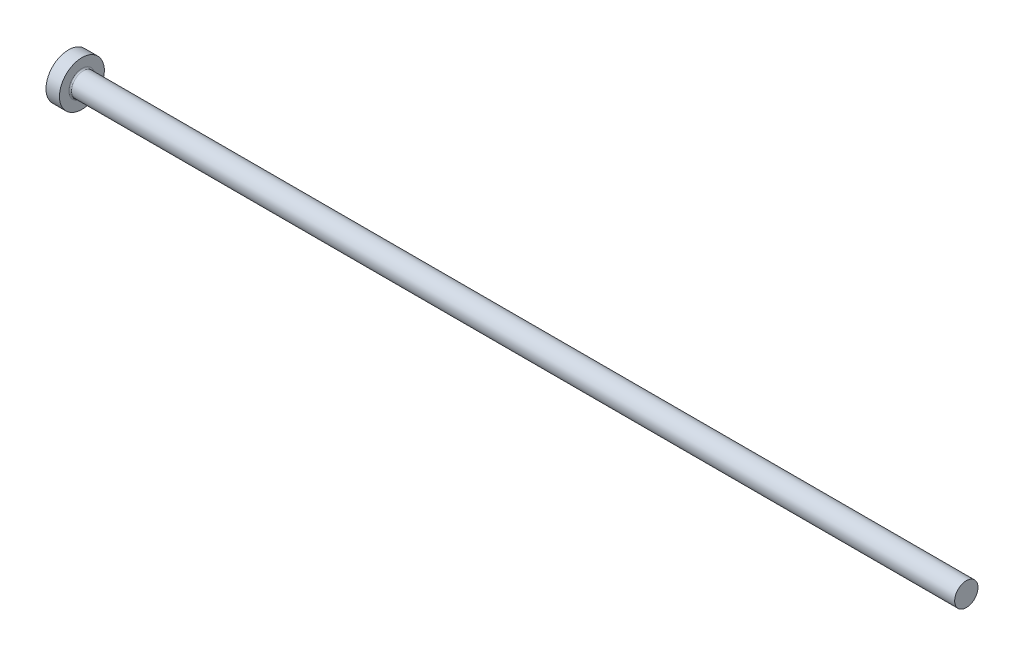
ISO-10303-21;
HEADER;
FILE_DESCRIPTION(('STEP AP214'),'2;1');
FILE_NAME('part.step','',(''),(''),'','','');
FILE_SCHEMA(('AUTOMOTIVE_DESIGN { 1 0 10303 214 1 1 1 1 }'));
ENDSEC;
DATA;
#1=APPLICATION_CONTEXT('core data for automotive mechanical design processes');
#2=APPLICATION_PROTOCOL_DEFINITION('international standard','automotive_design',2000,#1);
#3=PRODUCT_CONTEXT('',#1,'mechanical');
#4=PRODUCT('Part','Part','',(#3));
#5=PRODUCT_RELATED_PRODUCT_CATEGORY('part','',(#4));
#6=PRODUCT_DEFINITION_FORMATION('','',#4);
#7=PRODUCT_DEFINITION_CONTEXT('part definition',#1,'design');
#8=PRODUCT_DEFINITION('design','',#6,#7);
#9=PRODUCT_DEFINITION_SHAPE('','',#8);
#10=(LENGTH_UNIT() NAMED_UNIT(*) SI_UNIT(.MILLI.,.METRE.));
#11=(NAMED_UNIT(*) PLANE_ANGLE_UNIT() SI_UNIT($,.RADIAN.));
#12=(NAMED_UNIT(*) SI_UNIT($,.STERADIAN.) SOLID_ANGLE_UNIT());
#13=UNCERTAINTY_MEASURE_WITH_UNIT(LENGTH_MEASURE(1.E-05),#10,'distance_accuracy_value','');
#14=(GEOMETRIC_REPRESENTATION_CONTEXT(3) GLOBAL_UNCERTAINTY_ASSIGNED_CONTEXT((#13)) GLOBAL_UNIT_ASSIGNED_CONTEXT((#10,
#11,#12)) REPRESENTATION_CONTEXT('',''));
#15=CARTESIAN_POINT('',(0.,0.,0.));
#16=DIRECTION('',(0.,0.,1.));
#17=DIRECTION('',(1.,0.,0.));
#18=AXIS2_PLACEMENT_3D('',#15,#16,#17);
#19=CARTESIAN_POINT('',(0.,0.,0.));
#20=DIRECTION('',(-1.,0.,0.));
#21=DIRECTION('',(0.,-1.,0.));
#22=AXIS2_PLACEMENT_3D('',#19,#20,#21);
#23=PLANE('',#22);
#24=CARTESIAN_POINT('',(0.,0.,0.));
#25=DIRECTION('',(1.,0.,0.));
#26=DIRECTION('',(0.,1.,0.));
#27=AXIS2_PLACEMENT_3D('',#24,#25,#26);
#28=CIRCLE('',#27,5.);
#29=CARTESIAN_POINT('',(0.,5.,0.));
#30=VERTEX_POINT('',#29);
#31=EDGE_CURVE('E25',#30,#30,#28,.T.);
#32=ORIENTED_EDGE('',*,*,#31,.F.);
#33=EDGE_LOOP('',(#32));
#34=FACE_BOUND('',#33,.T.);
#35=ADVANCED_FACE('F14',(#34),#23,.T.);
#36=CARTESIAN_POINT('',(200.,0.,0.));
#37=DIRECTION('',(1.,0.,0.));
#38=DIRECTION('',(0.,1.,0.));
#39=AXIS2_PLACEMENT_3D('',#36,#37,#38);
#40=CYLINDRICAL_SURFACE('',#39,5.);
#41=ORIENTED_EDGE('',*,*,#31,.T.);
#42=EDGE_LOOP('',(#41));
#43=FACE_BOUND('',#42,.T.);
#44=CARTESIAN_POINT('',(3.,0.,0.));
#45=DIRECTION('',(1.,0.,0.));
#46=DIRECTION('',(0.,1.,0.));
#47=AXIS2_PLACEMENT_3D('',#44,#45,#46);
#48=CIRCLE('',#47,5.);
#49=CARTESIAN_POINT('',(3.,5.,0.));
#50=VERTEX_POINT('',#49);
#51=EDGE_CURVE('E29',#50,#50,#48,.T.);
#52=ORIENTED_EDGE('',*,*,#51,.F.);
#53=EDGE_LOOP('',(#52));
#54=FACE_BOUND('',#53,.T.);
#55=ADVANCED_FACE('F51',(#43,#54),#40,.T.);
#56=CARTESIAN_POINT('',(3.,5.,0.));
#57=DIRECTION('',(1.,0.,0.));
#58=DIRECTION('',(0.,1.,0.));
#59=AXIS2_PLACEMENT_3D('',#56,#57,#58);
#60=PLANE('',#59);
#61=CARTESIAN_POINT('',(3.,0.,0.));
#62=DIRECTION('',(1.,0.,0.));
#63=DIRECTION('',(0.,1.,0.));
#64=AXIS2_PLACEMENT_3D('',#61,#62,#63);
#65=CIRCLE('',#64,2.89999999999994);
#66=CARTESIAN_POINT('',(3.,2.89999999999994,0.));
#67=VERTEX_POINT('',#66);
#68=EDGE_CURVE('E9',#67,#67,#65,.F.);
#69=ORIENTED_EDGE('',*,*,#68,.T.);
#70=EDGE_LOOP('',(#69));
#71=FACE_BOUND('',#70,.T.);
#72=ORIENTED_EDGE('',*,*,#51,.T.);
#73=EDGE_LOOP('',(#72));
#74=FACE_BOUND('',#73,.T.);
#75=ADVANCED_FACE('F42',(#71,#74),#60,.T.);
#76=CARTESIAN_POINT('',(200.,0.,0.));
#77=DIRECTION('',(1.,0.,0.));
#78=DIRECTION('',(0.,1.,0.));
#79=AXIS2_PLACEMENT_3D('',#76,#77,#78);
#80=CYLINDRICAL_SURFACE('',#79,2.59999999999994);
#81=CARTESIAN_POINT('',(3.3,0.,0.));
#82=DIRECTION('',(1.,0.,0.));
#83=DIRECTION('',(0.,1.,0.));
#84=AXIS2_PLACEMENT_3D('',#81,#82,#83);
#85=CIRCLE('',#84,2.59999999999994);
#86=CARTESIAN_POINT('',(3.3,2.59999999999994,0.));
#87=VERTEX_POINT('',#86);
#88=EDGE_CURVE('E21',#87,#87,#85,.T.);
#89=ORIENTED_EDGE('',*,*,#88,.T.);
#90=EDGE_LOOP('',(#89));
#91=FACE_BOUND('',#90,.T.);
#92=CARTESIAN_POINT('',(200.,0.,0.));
#93=DIRECTION('',(1.,0.,0.));
#94=DIRECTION('',(0.,1.,0.));
#95=AXIS2_PLACEMENT_3D('',#92,#93,#94);
#96=CIRCLE('',#95,2.6);
#97=CARTESIAN_POINT('',(200.,2.6,0.));
#98=VERTEX_POINT('',#97);
#99=EDGE_CURVE('E34',#98,#98,#96,.T.);
#100=ORIENTED_EDGE('',*,*,#99,.F.);
#101=EDGE_LOOP('',(#100));
#102=FACE_BOUND('',#101,.T.);
#103=ADVANCED_FACE('F40',(#91,#102),#80,.T.);
#104=CARTESIAN_POINT('',(200.,2.6,0.));
#105=DIRECTION('',(1.,0.,0.));
#106=DIRECTION('',(0.,1.,0.));
#107=AXIS2_PLACEMENT_3D('',#104,#105,#106);
#108=PLANE('',#107);
#109=ORIENTED_EDGE('',*,*,#99,.T.);
#110=EDGE_LOOP('',(#109));
#111=FACE_BOUND('',#110,.T.);
#112=ADVANCED_FACE('F38',(#111),#108,.T.);
#113=CARTESIAN_POINT('',(3.3,0.,0.));
#114=DIRECTION('',(1.,0.,0.));
#115=DIRECTION('',(0.,1.,0.));
#116=AXIS2_PLACEMENT_3D('',#113,#114,#115);
#117=TOROIDAL_SURFACE('',#116,2.89999999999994,0.3);
#118=ORIENTED_EDGE('',*,*,#68,.F.);
#119=EDGE_LOOP('',(#118));
#120=FACE_BOUND('',#119,.T.);
#121=ORIENTED_EDGE('',*,*,#88,.F.);
#122=EDGE_LOOP('',(#121));
#123=FACE_BOUND('',#122,.T.);
#124=ADVANCED_FACE('F16',(#120,#123),#117,.F.);
#125=CLOSED_SHELL('',(#35,#55,#75,#103,#112,#124));
#126=MANIFOLD_SOLID_BREP('B1',#125);
#127=ADVANCED_BREP_SHAPE_REPRESENTATION('',(#18,#126),#14);
#128=SHAPE_DEFINITION_REPRESENTATION(#9,#127);
ENDSEC;
END-ISO-10303-21;
